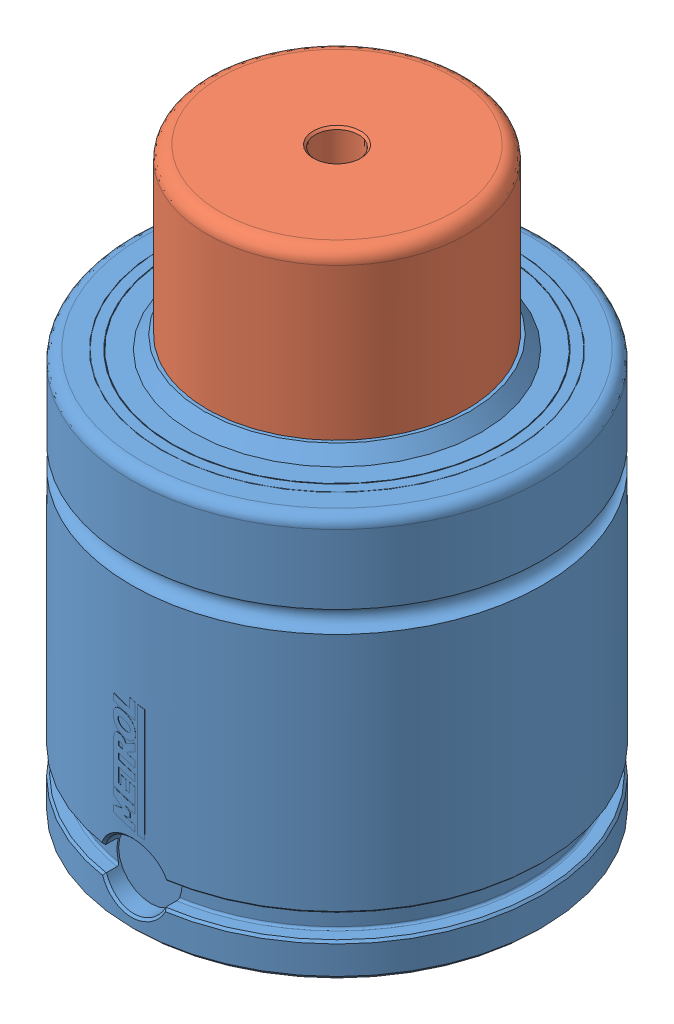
SolidWorks assembly EX4200-038.SLDASM, configuration Default (file format 7000). Lengths in mm.
Overall size (107.39 134 107.39).
2 component instances, 2 part files, 5 mates.
Components (placement in the parent):
- EX4200 Body-1: EX4200 Body.SLDPRT [EX-4200-038] x (0 0 1) z (0 -1 0) size (95.1 95 96)
- EX4200 Piston-1: EX4200 Piston.SLDPRT [EX-4200-038] at (0 78 0) x (-0.448624 0 -0.893721) z (0 -1 0) size (80 80 56)
Mates (geometry in assembly coordinates):
- Concentric1: concentric aligned: cylinder of EX4200 Body-1 through (0 0 0) axis (0 -1 0) radius 30; cylinder of EX4200 Piston-1 through (0 78 0) axis (0 -1 0) radius 30
- LimitDistance1: limit distance anti-aligned: plane of EX4200 Body-1 through (-30 83 0) normal (0 -1 0); plane of EX4200 Piston-1 through (35.7488 83 -17.9449) normal (0 1 0)
- Coincident1: coincident anti-aligned: plane of EX4200 Body-1 through (0 0 0) normal (0 -1 0); plane of assembly through (0 0 0) normal (0 1 0)
- Coincident2: coincident anti-aligned: plane of EX4200 Body-1; plane of assembly through (0 0 0) normal (1 0 0)
- Coincident3: coincident aligned: plane of EX4200 Body-1; plane of assembly through (0 0 0) normal (0 0 1)
